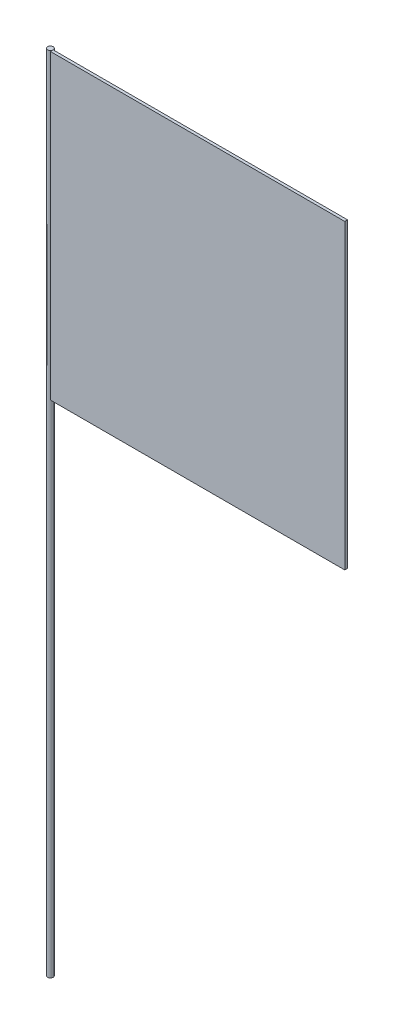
from build123d import *

# Parameters (mm, degrees)
SKETCH1_R           = 0.5
BOSS_EXTRUDE1_DEPTH = 145
SKETCH3_W           = 53.139248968
SKETCH3_H           = 54.493819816
BOSS_EXTRUDE3_DEPTH = 0.5


with BuildPart() as part:
    # Sketch1 → Boss-Extrude1 (new body)
    with BuildSketch(Plane(origin=(0, 0, 0), x_dir=(1, 0, 0), z_dir=(0, 1, 0))):
        with Locations(Location((0, 0, 0), (0, 0, 270))):
            Circle(SKETCH1_R)
    extrude(amount=BOSS_EXTRUDE1_DEPTH)


with BuildPart() as body_2:
    # Sketch3 → Boss-Extrude3 (new body)
    with BuildSketch(Plane.XY):
        with Locations((27.069624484, 117.753090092)):
            Rectangle(SKETCH3_W, SKETCH3_H)
    extrude(amount=BOSS_EXTRUDE3_DEPTH)


solid = Compound([part.part, body_2.part])
